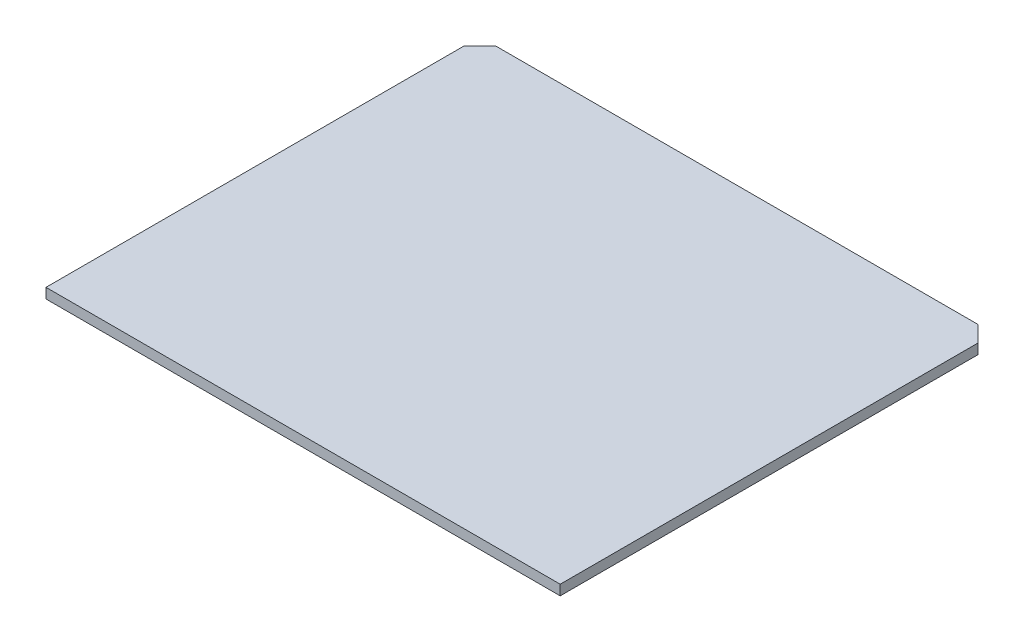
from build123d import *

# Parameters (mm, degrees)
SKETCH1_W           = 81.28
SKETCH1_H           = 68.58
BOSS_EXTRUDE1_DEPTH = 1.6
CHAMFER1_SIZE       = 2.54


with BuildPart() as part:
    # Sketch1 → Boss-Extrude1 (new body)
    with BuildSketch(Plane(origin=(0, 0, 0), x_dir=(1, 0, 0), z_dir=(0, 1, 0))):
        Rectangle(SKETCH1_W, SKETCH1_H)
    extrude(amount=BOSS_EXTRUDE1_DEPTH)

    # Chamfer1
    chamfer1_edges = [part.edges().sort_by_distance(p)[0] for p in [
        (-40.64, 0.8, -34.29),
        (40.64, 0.8, -34.29),
    ]]
    chamfer(chamfer1_edges, length=CHAMFER1_SIZE)


solid = part.part
